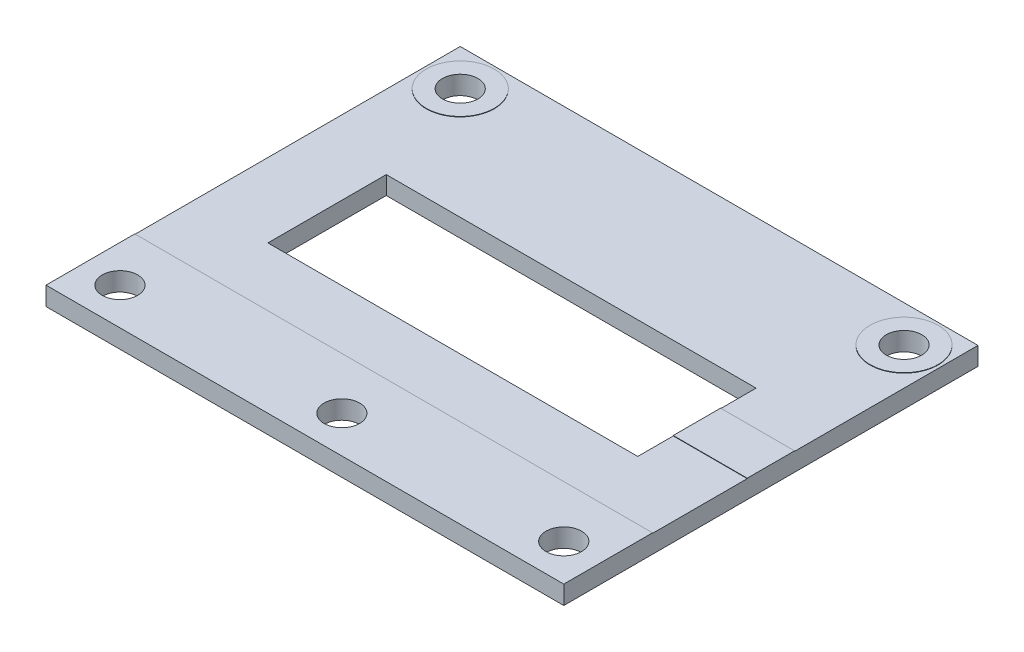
ISO-10303-21;
HEADER;
FILE_DESCRIPTION(('STEP AP214'),'2;1');
FILE_NAME('part.step','',(''),(''),'','','');
FILE_SCHEMA(('AUTOMOTIVE_DESIGN { 1 0 10303 214 1 1 1 1 }'));
ENDSEC;
DATA;
#1=APPLICATION_CONTEXT('core data for automotive mechanical design processes');
#2=APPLICATION_PROTOCOL_DEFINITION('international standard','automotive_design',2000,#1);
#3=PRODUCT_CONTEXT('',#1,'mechanical');
#4=PRODUCT('Part','Part','',(#3));
#5=PRODUCT_RELATED_PRODUCT_CATEGORY('part','',(#4));
#6=PRODUCT_DEFINITION_FORMATION('','',#4);
#7=PRODUCT_DEFINITION_CONTEXT('part definition',#1,'design');
#8=PRODUCT_DEFINITION('design','',#6,#7);
#9=PRODUCT_DEFINITION_SHAPE('','',#8);
#10=(LENGTH_UNIT() NAMED_UNIT(*) SI_UNIT(.MILLI.,.METRE.));
#11=(NAMED_UNIT(*) PLANE_ANGLE_UNIT() SI_UNIT($,.RADIAN.));
#12=(NAMED_UNIT(*) SI_UNIT($,.STERADIAN.) SOLID_ANGLE_UNIT());
#13=UNCERTAINTY_MEASURE_WITH_UNIT(LENGTH_MEASURE(1.E-05),#10,'distance_accuracy_value','');
#14=(GEOMETRIC_REPRESENTATION_CONTEXT(3) GLOBAL_UNCERTAINTY_ASSIGNED_CONTEXT((#13)) GLOBAL_UNIT_ASSIGNED_CONTEXT((#10,
#11,#12)) REPRESENTATION_CONTEXT('',''));
#15=CARTESIAN_POINT('',(0.,0.,0.));
#16=DIRECTION('',(0.,0.,1.));
#17=DIRECTION('',(1.,0.,0.));
#18=AXIS2_PLACEMENT_3D('',#15,#16,#17);
#19=CARTESIAN_POINT('',(0.,1.524,0.));
#20=DIRECTION('',(0.,-1.,0.));
#21=DIRECTION('',(0.,0.,-1.));
#22=AXIS2_PLACEMENT_3D('',#19,#20,#21);
#23=PLANE('',#22);
#24=CARTESIAN_POINT('',(-19.05,1.524,-14.605));
#25=DIRECTION('',(0.,-1.,0.));
#26=DIRECTION('',(0.,0.,-1.));
#27=AXIS2_PLACEMENT_3D('',#24,#25,#26);
#28=CIRCLE('',#27,2.921);
#29=CARTESIAN_POINT('',(-19.05,1.524,-17.526));
#30=VERTEX_POINT('',#29);
#31=EDGE_CURVE('E47',#30,#30,#28,.F.);
#32=ORIENTED_EDGE('',*,*,#31,.F.);
#33=EDGE_LOOP('',(#32));
#34=FACE_BOUND('',#33,.T.);
#35=CARTESIAN_POINT('',(19.05,1.524,-14.605));
#36=DIRECTION('',(0.,-1.,0.));
#37=DIRECTION('',(0.,0.,-1.));
#38=AXIS2_PLACEMENT_3D('',#35,#36,#37);
#39=CIRCLE('',#38,2.921);
#40=CARTESIAN_POINT('',(19.05,1.524,-17.526));
#41=VERTEX_POINT('',#40);
#42=EDGE_CURVE('E11',#41,#41,#39,.F.);
#43=ORIENTED_EDGE('',*,*,#42,.F.);
#44=EDGE_LOOP('',(#43));
#45=FACE_BOUND('',#44,.T.);
#46=DIRECTION('',(-1.,0.,0.));
#47=VECTOR('',#46,1.);
#48=CARTESIAN_POINT('',(15.875,1.524,-2.032));
#49=LINE('',#48,#47);
#50=CARTESIAN_POINT('',(22.225,1.524,-2.032));
#51=VERTEX_POINT('',#50);
#52=CARTESIAN_POINT('',(15.875,1.524,-2.032));
#53=VERTEX_POINT('',#52);
#54=EDGE_CURVE('E298',#51,#53,#49,.T.);
#55=ORIENTED_EDGE('',*,*,#54,.F.);
#56=DIRECTION('',(0.,0.,-1.));
#57=VECTOR('',#56,1.);
#58=CARTESIAN_POINT('',(22.225,1.524,17.78));
#59=LINE('',#58,#57);
#60=CARTESIAN_POINT('',(22.225,1.524,-17.78));
#61=VERTEX_POINT('',#60);
#62=EDGE_CURVE('E165',#51,#61,#59,.T.);
#63=ORIENTED_EDGE('',*,*,#62,.T.);
#64=DIRECTION('',(-1.,0.,0.));
#65=VECTOR('',#64,1.);
#66=CARTESIAN_POINT('',(-22.225,1.524,-17.78));
#67=LINE('',#66,#65);
#68=CARTESIAN_POINT('',(-22.225,1.524,-17.78));
#69=VERTEX_POINT('',#68);
#70=EDGE_CURVE('E277',#61,#69,#67,.T.);
#71=ORIENTED_EDGE('',*,*,#70,.T.);
#72=DIRECTION('',(0.,0.,1.));
#73=VECTOR('',#72,1.);
#74=CARTESIAN_POINT('',(-22.225,1.524,17.78));
#75=LINE('',#74,#73);
#76=CARTESIAN_POINT('',(-22.225,1.524,10.16));
#77=VERTEX_POINT('',#76);
#78=EDGE_CURVE('E279',#69,#77,#75,.T.);
#79=ORIENTED_EDGE('',*,*,#78,.T.);
#80=DIRECTION('',(-1.,0.,0.));
#81=VECTOR('',#80,1.);
#82=CARTESIAN_POINT('',(-22.225,1.524,10.16));
#83=LINE('',#82,#81);
#84=CARTESIAN_POINT('',(22.225,1.524,10.16));
#85=VERTEX_POINT('',#84);
#86=EDGE_CURVE('E255',#85,#77,#83,.T.);
#87=ORIENTED_EDGE('',*,*,#86,.F.);
#88=CARTESIAN_POINT('',(22.225,1.524,2.032));
#89=VERTEX_POINT('',#88);
#90=EDGE_CURVE('E274',#85,#89,#59,.T.);
#91=ORIENTED_EDGE('',*,*,#90,.T.);
#92=DIRECTION('',(1.,0.,0.));
#93=VECTOR('',#92,1.);
#94=CARTESIAN_POINT('',(15.875,1.524,2.032));
#95=LINE('',#94,#93);
#96=CARTESIAN_POINT('',(15.875,1.524,2.032));
#97=VERTEX_POINT('',#96);
#98=EDGE_CURVE('E161',#97,#89,#95,.T.);
#99=ORIENTED_EDGE('',*,*,#98,.F.);
#100=DIRECTION('',(0.,0.,-1.));
#101=VECTOR('',#100,1.);
#102=CARTESIAN_POINT('',(15.875,1.524,5.08));
#103=LINE('',#102,#101);
#104=CARTESIAN_POINT('',(15.875,1.524,5.08));
#105=VERTEX_POINT('',#104);
#106=EDGE_CURVE('E219',#105,#97,#103,.T.);
#107=ORIENTED_EDGE('',*,*,#106,.F.);
#108=DIRECTION('',(1.,0.,0.));
#109=VECTOR('',#108,1.);
#110=CARTESIAN_POINT('',(-15.875,1.524,5.08));
#111=LINE('',#110,#109);
#112=CARTESIAN_POINT('',(-15.875,1.524,5.08));
#113=VERTEX_POINT('',#112);
#114=EDGE_CURVE('E209',#113,#105,#111,.T.);
#115=ORIENTED_EDGE('',*,*,#114,.F.);
#116=DIRECTION('',(0.,0.,1.));
#117=VECTOR('',#116,1.);
#118=CARTESIAN_POINT('',(-15.875,1.524,5.08));
#119=LINE('',#118,#117);
#120=CARTESIAN_POINT('',(-15.875,1.524,-5.08));
#121=VERTEX_POINT('',#120);
#122=EDGE_CURVE('E225',#121,#113,#119,.T.);
#123=ORIENTED_EDGE('',*,*,#122,.F.);
#124=DIRECTION('',(-1.,0.,0.));
#125=VECTOR('',#124,1.);
#126=CARTESIAN_POINT('',(-15.875,1.524,-5.08));
#127=LINE('',#126,#125);
#128=CARTESIAN_POINT('',(15.875,1.524,-5.08));
#129=VERTEX_POINT('',#128);
#130=EDGE_CURVE('E222',#129,#121,#127,.T.);
#131=ORIENTED_EDGE('',*,*,#130,.F.);
#132=EDGE_CURVE('E62',#53,#129,#103,.T.);
#133=ORIENTED_EDGE('',*,*,#132,.F.);
#134=EDGE_LOOP('',(#55,#63,#71,#79,#87,#91,#99,#107,#115,#123,#131,#133));
#135=FACE_BOUND('',#134,.T.);
#136=ADVANCED_FACE('F39',(#34,#45,#135),#23,.F.);
#137=CARTESIAN_POINT('',(22.225,1.524,17.78));
#138=DIRECTION('',(-1.,0.,0.));
#139=DIRECTION('',(0.,0.,1.));
#140=AXIS2_PLACEMENT_3D('',#137,#138,#139);
#141=PLANE('',#140);
#142=DIRECTION('',(0.,-1.,0.));
#143=VECTOR('',#142,1.);
#144=CARTESIAN_POINT('',(22.225,1.524,17.78));
#145=LINE('',#144,#143);
#146=CARTESIAN_POINT('',(22.225,1.55956,17.78));
#147=VERTEX_POINT('',#146);
#148=CARTESIAN_POINT('',(22.225,-0.03556,17.78));
#149=VERTEX_POINT('',#148);
#150=EDGE_CURVE('E281',#147,#149,#145,.T.);
#151=ORIENTED_EDGE('',*,*,#150,.T.);
#152=DIRECTION('',(0.,0.,1.));
#153=VECTOR('',#152,1.);
#154=CARTESIAN_POINT('',(22.225,-0.03556,-17.78));
#155=LINE('',#154,#153);
#156=CARTESIAN_POINT('',(22.225,-0.03556,-17.78));
#157=VERTEX_POINT('',#156);
#158=EDGE_CURVE('E232',#157,#149,#155,.T.);
#159=ORIENTED_EDGE('',*,*,#158,.F.);
#160=DIRECTION('',(0.,-1.,0.));
#161=VECTOR('',#160,1.);
#162=CARTESIAN_POINT('',(22.225,1.524,-17.78));
#163=LINE('',#162,#161);
#164=EDGE_CURVE('E287',#61,#157,#163,.T.);
#165=ORIENTED_EDGE('',*,*,#164,.F.);
#166=ORIENTED_EDGE('',*,*,#62,.F.);
#167=DIRECTION('',(0.,-1.,0.));
#168=VECTOR('',#167,1.);
#169=CARTESIAN_POINT('',(22.225,1.55956,-2.032));
#170=LINE('',#169,#168);
#171=CARTESIAN_POINT('',(22.225,1.55956,-2.032));
#172=VERTEX_POINT('',#171);
#173=EDGE_CURVE('E146',#172,#51,#170,.T.);
#174=ORIENTED_EDGE('',*,*,#173,.F.);
#175=DIRECTION('',(0.,0.,-1.));
#176=VECTOR('',#175,1.);
#177=CARTESIAN_POINT('',(22.225,1.55956,2.032));
#178=LINE('',#177,#176);
#179=CARTESIAN_POINT('',(22.225,1.55956,2.032));
#180=VERTEX_POINT('',#179);
#181=EDGE_CURVE('E151',#180,#172,#178,.T.);
#182=ORIENTED_EDGE('',*,*,#181,.F.);
#183=DIRECTION('',(0.,-1.,0.));
#184=VECTOR('',#183,1.);
#185=CARTESIAN_POINT('',(22.225,1.55956,2.032));
#186=LINE('',#185,#184);
#187=EDGE_CURVE('E308',#180,#89,#186,.T.);
#188=ORIENTED_EDGE('',*,*,#187,.T.);
#189=ORIENTED_EDGE('',*,*,#90,.F.);
#190=DIRECTION('',(0.,-1.,0.));
#191=VECTOR('',#190,1.);
#192=CARTESIAN_POINT('',(22.225,1.55956,10.16));
#193=LINE('',#192,#191);
#194=CARTESIAN_POINT('',(22.225,1.55956,10.16));
#195=VERTEX_POINT('',#194);
#196=EDGE_CURVE('E271',#195,#85,#193,.T.);
#197=ORIENTED_EDGE('',*,*,#196,.F.);
#198=DIRECTION('',(0.,0.,-1.));
#199=VECTOR('',#198,1.);
#200=CARTESIAN_POINT('',(22.225,1.55956,10.16));
#201=LINE('',#200,#199);
#202=EDGE_CURVE('E262',#147,#195,#201,.T.);
#203=ORIENTED_EDGE('',*,*,#202,.F.);
#204=EDGE_LOOP('',(#151,#159,#165,#166,#174,#182,#188,#189,#197,#203));
#205=FACE_BOUND('',#204,.T.);
#206=ADVANCED_FACE('F41',(#205),#141,.F.);
#207=CARTESIAN_POINT('',(-22.225,1.524,-17.78));
#208=DIRECTION('',(0.,0.,1.));
#209=DIRECTION('',(1.,0.,0.));
#210=AXIS2_PLACEMENT_3D('',#207,#208,#209);
#211=PLANE('',#210);
#212=ORIENTED_EDGE('',*,*,#164,.T.);
#213=DIRECTION('',(1.,0.,0.));
#214=VECTOR('',#213,1.);
#215=CARTESIAN_POINT('',(-22.225,-0.03556,-17.78));
#216=LINE('',#215,#214);
#217=CARTESIAN_POINT('',(-22.225,-0.03556,-17.78));
#218=VERTEX_POINT('',#217);
#219=EDGE_CURVE('E246',#218,#157,#216,.T.);
#220=ORIENTED_EDGE('',*,*,#219,.F.);
#221=DIRECTION('',(0.,-1.,0.));
#222=VECTOR('',#221,1.);
#223=CARTESIAN_POINT('',(-22.225,1.524,-17.78));
#224=LINE('',#223,#222);
#225=EDGE_CURVE('E285',#69,#218,#224,.T.);
#226=ORIENTED_EDGE('',*,*,#225,.F.);
#227=ORIENTED_EDGE('',*,*,#70,.F.);
#228=EDGE_LOOP('',(#212,#220,#226,#227));
#229=FACE_BOUND('',#228,.T.);
#230=ADVANCED_FACE('F350',(#229),#211,.F.);
#231=CARTESIAN_POINT('',(-22.225,1.524,17.78));
#232=DIRECTION('',(1.,0.,0.));
#233=DIRECTION('',(0.,0.,-1.));
#234=AXIS2_PLACEMENT_3D('',#231,#232,#233);
#235=PLANE('',#234);
#236=ORIENTED_EDGE('',*,*,#225,.T.);
#237=DIRECTION('',(0.,0.,-1.));
#238=VECTOR('',#237,1.);
#239=CARTESIAN_POINT('',(-22.225,-0.03556,-17.78));
#240=LINE('',#239,#238);
#241=CARTESIAN_POINT('',(-22.225,-0.03556,17.78));
#242=VERTEX_POINT('',#241);
#243=EDGE_CURVE('E243',#242,#218,#240,.T.);
#244=ORIENTED_EDGE('',*,*,#243,.F.);
#245=DIRECTION('',(0.,-1.,0.));
#246=VECTOR('',#245,1.);
#247=CARTESIAN_POINT('',(-22.225,1.524,17.78));
#248=LINE('',#247,#246);
#249=CARTESIAN_POINT('',(-22.225,1.55956,17.78));
#250=VERTEX_POINT('',#249);
#251=EDGE_CURVE('E283',#250,#242,#248,.T.);
#252=ORIENTED_EDGE('',*,*,#251,.F.);
#253=DIRECTION('',(0.,0.,1.));
#254=VECTOR('',#253,1.);
#255=CARTESIAN_POINT('',(-22.225,1.55956,17.78));
#256=LINE('',#255,#254);
#257=CARTESIAN_POINT('',(-22.225,1.55956,10.16));
#258=VERTEX_POINT('',#257);
#259=EDGE_CURVE('E256',#258,#250,#256,.T.);
#260=ORIENTED_EDGE('',*,*,#259,.F.);
#261=DIRECTION('',(0.,-1.,0.));
#262=VECTOR('',#261,1.);
#263=CARTESIAN_POINT('',(-22.225,1.55956,10.16));
#264=LINE('',#263,#262);
#265=EDGE_CURVE('E266',#258,#77,#264,.T.);
#266=ORIENTED_EDGE('',*,*,#265,.T.);
#267=ORIENTED_EDGE('',*,*,#78,.F.);
#268=EDGE_LOOP('',(#236,#244,#252,#260,#266,#267));
#269=FACE_BOUND('',#268,.T.);
#270=ADVANCED_FACE('F346',(#269),#235,.F.);
#271=CARTESIAN_POINT('',(-22.225,1.524,17.78));
#272=DIRECTION('',(0.,0.,-1.));
#273=DIRECTION('',(-1.,0.,0.));
#274=AXIS2_PLACEMENT_3D('',#271,#272,#273);
#275=PLANE('',#274);
#276=ORIENTED_EDGE('',*,*,#251,.T.);
#277=DIRECTION('',(-1.,0.,0.));
#278=VECTOR('',#277,1.);
#279=CARTESIAN_POINT('',(-22.225,-0.03556,17.78));
#280=LINE('',#279,#278);
#281=EDGE_CURVE('E240',#149,#242,#280,.T.);
#282=ORIENTED_EDGE('',*,*,#281,.F.);
#283=ORIENTED_EDGE('',*,*,#150,.F.);
#284=DIRECTION('',(1.,0.,0.));
#285=VECTOR('',#284,1.);
#286=CARTESIAN_POINT('',(22.225,1.55956,17.78));
#287=LINE('',#286,#285);
#288=EDGE_CURVE('E259',#250,#147,#287,.T.);
#289=ORIENTED_EDGE('',*,*,#288,.F.);
#290=EDGE_LOOP('',(#276,#282,#283,#289));
#291=FACE_BOUND('',#290,.T.);
#292=ADVANCED_FACE('F343',(#291),#275,.F.);
#293=CARTESIAN_POINT('',(-22.225,1.55956,10.16));
#294=DIRECTION('',(0.,0.,1.));
#295=DIRECTION('',(1.,0.,0.));
#296=AXIS2_PLACEMENT_3D('',#293,#294,#295);
#297=PLANE('',#296);
#298=ORIENTED_EDGE('',*,*,#86,.T.);
#299=ORIENTED_EDGE('',*,*,#265,.F.);
#300=DIRECTION('',(-1.,0.,0.));
#301=VECTOR('',#300,1.);
#302=CARTESIAN_POINT('',(-22.225,1.55956,10.16));
#303=LINE('',#302,#301);
#304=EDGE_CURVE('E264',#195,#258,#303,.T.);
#305=ORIENTED_EDGE('',*,*,#304,.F.);
#306=ORIENTED_EDGE('',*,*,#196,.T.);
#307=EDGE_LOOP('',(#298,#299,#305,#306));
#308=FACE_BOUND('',#307,.T.);
#309=ADVANCED_FACE('F353',(#308),#297,.F.);
#310=CARTESIAN_POINT('',(0.,1.55956,0.));
#311=DIRECTION('',(0.,-1.,0.));
#312=DIRECTION('',(0.,0.,-1.));
#313=AXIS2_PLACEMENT_3D('',#310,#311,#312);
#314=PLANE('',#313);
#315=CARTESIAN_POINT('',(0.,1.55956,14.605));
#316=DIRECTION('',(0.,1.,0.));
#317=DIRECTION('',(0.,0.,1.));
#318=AXIS2_PLACEMENT_3D('',#315,#316,#317);
#319=CIRCLE('',#318,1.524);
#320=CARTESIAN_POINT('',(0.,1.55956,16.129));
#321=VERTEX_POINT('',#320);
#322=EDGE_CURVE('E181',#321,#321,#319,.T.);
#323=ORIENTED_EDGE('',*,*,#322,.F.);
#324=EDGE_LOOP('',(#323));
#325=FACE_BOUND('',#324,.T.);
#326=CARTESIAN_POINT('',(-19.05,1.55956,14.605));
#327=DIRECTION('',(0.,1.,0.));
#328=DIRECTION('',(0.,0.,1.));
#329=AXIS2_PLACEMENT_3D('',#326,#327,#328);
#330=CIRCLE('',#329,1.524);
#331=CARTESIAN_POINT('',(-19.05,1.55956,16.129));
#332=VERTEX_POINT('',#331);
#333=EDGE_CURVE('E182',#332,#332,#330,.T.);
#334=ORIENTED_EDGE('',*,*,#333,.F.);
#335=EDGE_LOOP('',(#334));
#336=FACE_BOUND('',#335,.T.);
#337=CARTESIAN_POINT('',(19.05,1.55956,14.605));
#338=DIRECTION('',(0.,1.,0.));
#339=DIRECTION('',(0.,0.,1.));
#340=AXIS2_PLACEMENT_3D('',#337,#338,#339);
#341=CIRCLE('',#340,1.524);
#342=CARTESIAN_POINT('',(19.05,1.55956,16.129));
#343=VERTEX_POINT('',#342);
#344=EDGE_CURVE('E167',#343,#343,#341,.T.);
#345=ORIENTED_EDGE('',*,*,#344,.F.);
#346=EDGE_LOOP('',(#345));
#347=FACE_BOUND('',#346,.T.);
#348=ORIENTED_EDGE('',*,*,#259,.T.);
#349=ORIENTED_EDGE('',*,*,#288,.T.);
#350=ORIENTED_EDGE('',*,*,#202,.T.);
#351=ORIENTED_EDGE('',*,*,#304,.T.);
#352=EDGE_LOOP('',(#348,#349,#350,#351));
#353=FACE_BOUND('',#352,.T.);
#354=ADVANCED_FACE('F356',(#325,#336,#347,#353),#314,.F.);
#355=CARTESIAN_POINT('',(-19.05,1.55956,-14.605));
#356=DIRECTION('',(0.,-1.,0.));
#357=DIRECTION('',(0.,0.,-1.));
#358=AXIS2_PLACEMENT_3D('',#355,#356,#357);
#359=CYLINDRICAL_SURFACE('',#358,2.921);
#360=CARTESIAN_POINT('',(-19.05,1.55956,-14.605));
#361=DIRECTION('',(0.,1.,0.));
#362=DIRECTION('',(0.,0.,1.));
#363=AXIS2_PLACEMENT_3D('',#360,#361,#362);
#364=CIRCLE('',#363,2.921);
#365=CARTESIAN_POINT('',(-19.05,1.55956,-11.684));
#366=VERTEX_POINT('',#365);
#367=EDGE_CURVE('E252',#366,#366,#364,.T.);
#368=ORIENTED_EDGE('',*,*,#367,.F.);
#369=EDGE_LOOP('',(#368));
#370=FACE_BOUND('',#369,.T.);
#371=ORIENTED_EDGE('',*,*,#31,.T.);
#372=EDGE_LOOP('',(#371));
#373=FACE_BOUND('',#372,.T.);
#374=ADVANCED_FACE('F291',(#370,#373),#359,.T.);
#375=CARTESIAN_POINT('',(-19.05,1.55956,-14.605));
#376=DIRECTION('',(0.,1.,0.));
#377=DIRECTION('',(0.,0.,1.));
#378=AXIS2_PLACEMENT_3D('',#375,#376,#377);
#379=PLANE('',#378);
#380=CARTESIAN_POINT('',(-19.05,1.55956,-14.605));
#381=DIRECTION('',(0.,1.,0.));
#382=DIRECTION('',(0.,0.,1.));
#383=AXIS2_PLACEMENT_3D('',#380,#381,#382);
#384=CIRCLE('',#383,1.524);
#385=CARTESIAN_POINT('',(-19.05,1.55956,-13.081));
#386=VERTEX_POINT('',#385);
#387=EDGE_CURVE('E190',#386,#386,#384,.T.);
#388=ORIENTED_EDGE('',*,*,#387,.F.);
#389=EDGE_LOOP('',(#388));
#390=FACE_BOUND('',#389,.T.);
#391=ORIENTED_EDGE('',*,*,#367,.T.);
#392=EDGE_LOOP('',(#391));
#393=FACE_BOUND('',#392,.T.);
#394=ADVANCED_FACE('F364',(#390,#393),#379,.T.);
#395=CARTESIAN_POINT('',(19.05,1.55956,-14.605));
#396=DIRECTION('',(0.,-1.,0.));
#397=DIRECTION('',(0.,0.,-1.));
#398=AXIS2_PLACEMENT_3D('',#395,#396,#397);
#399=CYLINDRICAL_SURFACE('',#398,2.921);
#400=CARTESIAN_POINT('',(19.05,1.55956,-14.605));
#401=DIRECTION('',(0.,1.,0.));
#402=DIRECTION('',(0.,0.,1.));
#403=AXIS2_PLACEMENT_3D('',#400,#401,#402);
#404=CIRCLE('',#403,2.921);
#405=CARTESIAN_POINT('',(19.05,1.55956,-11.684));
#406=VERTEX_POINT('',#405);
#407=EDGE_CURVE('E249',#406,#406,#404,.T.);
#408=ORIENTED_EDGE('',*,*,#407,.F.);
#409=EDGE_LOOP('',(#408));
#410=FACE_BOUND('',#409,.T.);
#411=ORIENTED_EDGE('',*,*,#42,.T.);
#412=EDGE_LOOP('',(#411));
#413=FACE_BOUND('',#412,.T.);
#414=ADVANCED_FACE('F529',(#410,#413),#399,.T.);
#415=CARTESIAN_POINT('',(19.05,1.55956,-14.605));
#416=DIRECTION('',(0.,1.,0.));
#417=DIRECTION('',(0.,0.,1.));
#418=AXIS2_PLACEMENT_3D('',#415,#416,#417);
#419=PLANE('',#418);
#420=CARTESIAN_POINT('',(19.05,1.55956,-14.605));
#421=DIRECTION('',(0.,1.,0.));
#422=DIRECTION('',(0.,0.,1.));
#423=AXIS2_PLACEMENT_3D('',#420,#421,#422);
#424=CIRCLE('',#423,1.524);
#425=CARTESIAN_POINT('',(19.05,1.55956,-13.081));
#426=VERTEX_POINT('',#425);
#427=EDGE_CURVE('E191',#426,#426,#424,.T.);
#428=ORIENTED_EDGE('',*,*,#427,.F.);
#429=EDGE_LOOP('',(#428));
#430=FACE_BOUND('',#429,.T.);
#431=ORIENTED_EDGE('',*,*,#407,.T.);
#432=EDGE_LOOP('',(#431));
#433=FACE_BOUND('',#432,.T.);
#434=ADVANCED_FACE('F332',(#430,#433),#419,.T.);
#435=CARTESIAN_POINT('',(0.,-0.03556,0.));
#436=DIRECTION('',(0.,1.,0.));
#437=DIRECTION('',(0.,0.,1.));
#438=AXIS2_PLACEMENT_3D('',#435,#436,#437);
#439=PLANE('',#438);
#440=CARTESIAN_POINT('',(19.05,-0.03556,-14.605));
#441=DIRECTION('',(0.,1.,0.));
#442=DIRECTION('',(0.,0.,1.));
#443=AXIS2_PLACEMENT_3D('',#440,#441,#442);
#444=CIRCLE('',#443,1.524);
#445=CARTESIAN_POINT('',(19.05,-0.03556,-13.081));
#446=VERTEX_POINT('',#445);
#447=EDGE_CURVE('E187',#446,#446,#444,.T.);
#448=ORIENTED_EDGE('',*,*,#447,.T.);
#449=EDGE_LOOP('',(#448));
#450=FACE_BOUND('',#449,.T.);
#451=CARTESIAN_POINT('',(0.,-0.03556,14.605));
#452=DIRECTION('',(0.,1.,0.));
#453=DIRECTION('',(0.,0.,1.));
#454=AXIS2_PLACEMENT_3D('',#451,#452,#453);
#455=CIRCLE('',#454,1.524);
#456=CARTESIAN_POINT('',(0.,-0.03556,16.129));
#457=VERTEX_POINT('',#456);
#458=EDGE_CURVE('E194',#457,#457,#455,.T.);
#459=ORIENTED_EDGE('',*,*,#458,.T.);
#460=EDGE_LOOP('',(#459));
#461=FACE_BOUND('',#460,.T.);
#462=CARTESIAN_POINT('',(-19.05,-0.03556,14.605));
#463=DIRECTION('',(0.,1.,0.));
#464=DIRECTION('',(0.,0.,1.));
#465=AXIS2_PLACEMENT_3D('',#462,#463,#464);
#466=CIRCLE('',#465,1.524);
#467=CARTESIAN_POINT('',(-19.05,-0.03556,16.129));
#468=VERTEX_POINT('',#467);
#469=EDGE_CURVE('E178',#468,#468,#466,.T.);
#470=ORIENTED_EDGE('',*,*,#469,.T.);
#471=EDGE_LOOP('',(#470));
#472=FACE_BOUND('',#471,.T.);
#473=CARTESIAN_POINT('',(19.05,-0.03556,14.605));
#474=DIRECTION('',(0.,1.,0.));
#475=DIRECTION('',(0.,0.,1.));
#476=AXIS2_PLACEMENT_3D('',#473,#474,#475);
#477=CIRCLE('',#476,1.524);
#478=CARTESIAN_POINT('',(19.05,-0.03556,16.129));
#479=VERTEX_POINT('',#478);
#480=EDGE_CURVE('E171',#479,#479,#477,.T.);
#481=ORIENTED_EDGE('',*,*,#480,.T.);
#482=EDGE_LOOP('',(#481));
#483=FACE_BOUND('',#482,.T.);
#484=CARTESIAN_POINT('',(-19.05,-0.03556,-14.605));
#485=DIRECTION('',(0.,1.,0.));
#486=DIRECTION('',(0.,0.,1.));
#487=AXIS2_PLACEMENT_3D('',#484,#485,#486);
#488=CIRCLE('',#487,1.524);
#489=CARTESIAN_POINT('',(-19.05,-0.03556,-13.081));
#490=VERTEX_POINT('',#489);
#491=EDGE_CURVE('E199',#490,#490,#488,.T.);
#492=ORIENTED_EDGE('',*,*,#491,.T.);
#493=EDGE_LOOP('',(#492));
#494=FACE_BOUND('',#493,.T.);
#495=DIRECTION('',(1.,0.,0.));
#496=VECTOR('',#495,1.);
#497=CARTESIAN_POINT('',(-15.875,-0.03556,5.08));
#498=LINE('',#497,#496);
#499=CARTESIAN_POINT('',(-15.875,-0.03556,5.08));
#500=VERTEX_POINT('',#499);
#501=CARTESIAN_POINT('',(15.875,-0.03556,5.08));
#502=VERTEX_POINT('',#501);
#503=EDGE_CURVE('E215',#500,#502,#498,.T.);
#504=ORIENTED_EDGE('',*,*,#503,.T.);
#505=DIRECTION('',(0.,0.,-1.));
#506=VECTOR('',#505,1.);
#507=CARTESIAN_POINT('',(15.875,-0.03556,5.08));
#508=LINE('',#507,#506);
#509=CARTESIAN_POINT('',(15.875,-0.03556,-5.08));
#510=VERTEX_POINT('',#509);
#511=EDGE_CURVE('E204',#502,#510,#508,.T.);
#512=ORIENTED_EDGE('',*,*,#511,.T.);
#513=DIRECTION('',(-1.,0.,0.));
#514=VECTOR('',#513,1.);
#515=CARTESIAN_POINT('',(-15.875,-0.03556,-5.08));
#516=LINE('',#515,#514);
#517=CARTESIAN_POINT('',(-15.875,-0.03556,-5.08));
#518=VERTEX_POINT('',#517);
#519=EDGE_CURVE('E208',#510,#518,#516,.T.);
#520=ORIENTED_EDGE('',*,*,#519,.T.);
#521=DIRECTION('',(0.,0.,1.));
#522=VECTOR('',#521,1.);
#523=CARTESIAN_POINT('',(-15.875,-0.03556,5.08));
#524=LINE('',#523,#522);
#525=EDGE_CURVE('E212',#518,#500,#524,.T.);
#526=ORIENTED_EDGE('',*,*,#525,.T.);
#527=EDGE_LOOP('',(#504,#512,#520,#526));
#528=FACE_BOUND('',#527,.T.);
#529=ORIENTED_EDGE('',*,*,#158,.T.);
#530=ORIENTED_EDGE('',*,*,#281,.T.);
#531=ORIENTED_EDGE('',*,*,#243,.T.);
#532=ORIENTED_EDGE('',*,*,#219,.T.);
#533=EDGE_LOOP('',(#529,#530,#531,#532));
#534=FACE_BOUND('',#533,.T.);
#535=ADVANCED_FACE('F329',(#450,#461,#472,#483,#494,#528,#534),#439,.F.);
#536=CARTESIAN_POINT('',(15.875,-0.03556,5.08));
#537=DIRECTION('',(1.,0.,0.));
#538=DIRECTION('',(0.,0.,-1.));
#539=AXIS2_PLACEMENT_3D('',#536,#537,#538);
#540=PLANE('',#539);
#541=ORIENTED_EDGE('',*,*,#106,.T.);
#542=DIRECTION('',(0.,-1.,0.));
#543=VECTOR('',#542,1.);
#544=CARTESIAN_POINT('',(15.875,1.55956,2.032));
#545=LINE('',#544,#543);
#546=CARTESIAN_POINT('',(15.875,1.55956,2.032));
#547=VERTEX_POINT('',#546);
#548=EDGE_CURVE('E174',#547,#97,#545,.T.);
#549=ORIENTED_EDGE('',*,*,#548,.F.);
#550=DIRECTION('',(0.,0.,1.));
#551=VECTOR('',#550,1.);
#552=CARTESIAN_POINT('',(15.875,1.55956,2.032));
#553=LINE('',#552,#551);
#554=CARTESIAN_POINT('',(15.875,1.55956,-2.032));
#555=VERTEX_POINT('',#554);
#556=EDGE_CURVE('E150',#555,#547,#553,.T.);
#557=ORIENTED_EDGE('',*,*,#556,.F.);
#558=DIRECTION('',(0.,-1.,0.));
#559=VECTOR('',#558,1.);
#560=CARTESIAN_POINT('',(15.875,1.55956,-2.032));
#561=LINE('',#560,#559);
#562=EDGE_CURVE('E57',#555,#53,#561,.T.);
#563=ORIENTED_EDGE('',*,*,#562,.T.);
#564=ORIENTED_EDGE('',*,*,#132,.T.);
#565=DIRECTION('',(0.,1.,0.));
#566=VECTOR('',#565,1.);
#567=CARTESIAN_POINT('',(15.875,-0.03556,-5.08));
#568=LINE('',#567,#566);
#569=EDGE_CURVE('E218',#510,#129,#568,.T.);
#570=ORIENTED_EDGE('',*,*,#569,.F.);
#571=ORIENTED_EDGE('',*,*,#511,.F.);
#572=DIRECTION('',(0.,1.,0.));
#573=VECTOR('',#572,1.);
#574=CARTESIAN_POINT('',(15.875,-0.03556,5.08));
#575=LINE('',#574,#573);
#576=EDGE_CURVE('E230',#502,#105,#575,.T.);
#577=ORIENTED_EDGE('',*,*,#576,.T.);
#578=EDGE_LOOP('',(#541,#549,#557,#563,#564,#570,#571,#577));
#579=FACE_BOUND('',#578,.T.);
#580=ADVANCED_FACE('F316',(#579),#540,.F.);
#581=CARTESIAN_POINT('',(-15.875,-0.03556,5.08));
#582=DIRECTION('',(0.,0.,1.));
#583=DIRECTION('',(1.,0.,0.));
#584=AXIS2_PLACEMENT_3D('',#581,#582,#583);
#585=PLANE('',#584);
#586=ORIENTED_EDGE('',*,*,#114,.T.);
#587=ORIENTED_EDGE('',*,*,#576,.F.);
#588=ORIENTED_EDGE('',*,*,#503,.F.);
#589=DIRECTION('',(0.,1.,0.));
#590=VECTOR('',#589,1.);
#591=CARTESIAN_POINT('',(-15.875,-0.03556,5.08));
#592=LINE('',#591,#590);
#593=EDGE_CURVE('E233',#500,#113,#592,.T.);
#594=ORIENTED_EDGE('',*,*,#593,.T.);
#595=EDGE_LOOP('',(#586,#587,#588,#594));
#596=FACE_BOUND('',#595,.T.);
#597=ADVANCED_FACE('F320',(#596),#585,.F.);
#598=CARTESIAN_POINT('',(-15.875,-0.03556,5.08));
#599=DIRECTION('',(-1.,0.,0.));
#600=DIRECTION('',(0.,0.,1.));
#601=AXIS2_PLACEMENT_3D('',#598,#599,#600);
#602=PLANE('',#601);
#603=ORIENTED_EDGE('',*,*,#122,.T.);
#604=ORIENTED_EDGE('',*,*,#593,.F.);
#605=ORIENTED_EDGE('',*,*,#525,.F.);
#606=DIRECTION('',(0.,1.,0.));
#607=VECTOR('',#606,1.);
#608=CARTESIAN_POINT('',(-15.875,-0.03556,-5.08));
#609=LINE('',#608,#607);
#610=EDGE_CURVE('E235',#518,#121,#609,.T.);
#611=ORIENTED_EDGE('',*,*,#610,.T.);
#612=EDGE_LOOP('',(#603,#604,#605,#611));
#613=FACE_BOUND('',#612,.T.);
#614=ADVANCED_FACE('F323',(#613),#602,.F.);
#615=CARTESIAN_POINT('',(-15.875,-0.03556,-5.08));
#616=DIRECTION('',(0.,0.,-1.));
#617=DIRECTION('',(-1.,0.,0.));
#618=AXIS2_PLACEMENT_3D('',#615,#616,#617);
#619=PLANE('',#618);
#620=ORIENTED_EDGE('',*,*,#130,.T.);
#621=ORIENTED_EDGE('',*,*,#610,.F.);
#622=ORIENTED_EDGE('',*,*,#519,.F.);
#623=ORIENTED_EDGE('',*,*,#569,.T.);
#624=EDGE_LOOP('',(#620,#621,#622,#623));
#625=FACE_BOUND('',#624,.T.);
#626=ADVANCED_FACE('F327',(#625),#619,.F.);
#627=CARTESIAN_POINT('',(-19.05,-0.03556,-14.605));
#628=DIRECTION('',(0.,1.,0.));
#629=DIRECTION('',(0.,0.,1.));
#630=AXIS2_PLACEMENT_3D('',#627,#628,#629);
#631=CYLINDRICAL_SURFACE('',#630,1.524);
#632=CARTESIAN_POINT('',(-19.05,-0.03556,-13.081));
#633=CARTESIAN_POINT('',(-19.05,-0.0189441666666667,-13.081));
#634=CARTESIAN_POINT('',(-19.05,-0.00232833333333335,-13.081));
#635=CARTESIAN_POINT('',(-19.05,0.0309033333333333,-13.081));
#636=CARTESIAN_POINT('',(-19.05,0.0475191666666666,-13.081));
#637=CARTESIAN_POINT('',(-19.05,0.0807508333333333,-13.081));
#638=CARTESIAN_POINT('',(-19.05,0.0973666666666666,-13.081));
#639=CARTESIAN_POINT('',(-19.05,0.130598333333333,-13.081));
#640=CARTESIAN_POINT('',(-19.05,0.147214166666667,-13.081));
#641=CARTESIAN_POINT('',(-19.05,0.180445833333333,-13.081));
#642=CARTESIAN_POINT('',(-19.05,0.197061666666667,-13.081));
#643=CARTESIAN_POINT('',(-19.05,0.230293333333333,-13.081));
#644=CARTESIAN_POINT('',(-19.05,0.246909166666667,-13.081));
#645=CARTESIAN_POINT('',(-19.05,0.280140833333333,-13.081));
#646=CARTESIAN_POINT('',(-19.05,0.296756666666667,-13.081));
#647=CARTESIAN_POINT('',(-19.05,0.329988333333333,-13.081));
#648=CARTESIAN_POINT('',(-19.05,0.346604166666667,-13.081));
#649=CARTESIAN_POINT('',(-19.05,0.379835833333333,-13.081));
#650=CARTESIAN_POINT('',(-19.05,0.396451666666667,-13.081));
#651=CARTESIAN_POINT('',(-19.05,0.429683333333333,-13.081));
#652=CARTESIAN_POINT('',(-19.05,0.446299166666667,-13.081));
#653=CARTESIAN_POINT('',(-19.05,0.479530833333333,-13.081));
#654=CARTESIAN_POINT('',(-19.05,0.496146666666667,-13.081));
#655=CARTESIAN_POINT('',(-19.05,0.529378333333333,-13.081));
#656=CARTESIAN_POINT('',(-19.05,0.545994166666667,-13.081));
#657=CARTESIAN_POINT('',(-19.05,0.579225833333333,-13.081));
#658=CARTESIAN_POINT('',(-19.05,0.595841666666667,-13.081));
#659=CARTESIAN_POINT('',(-19.05,0.629073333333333,-13.081));
#660=CARTESIAN_POINT('',(-19.05,0.645689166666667,-13.081));
#661=CARTESIAN_POINT('',(-19.05,0.678920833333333,-13.081));
#662=CARTESIAN_POINT('',(-19.05,0.695536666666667,-13.081));
#663=CARTESIAN_POINT('',(-19.05,0.728768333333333,-13.081));
#664=CARTESIAN_POINT('',(-19.05,0.745384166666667,-13.081));
#665=CARTESIAN_POINT('',(-19.05,0.778615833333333,-13.081));
#666=CARTESIAN_POINT('',(-19.05,0.795231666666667,-13.081));
#667=CARTESIAN_POINT('',(-19.05,0.828463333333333,-13.081));
#668=CARTESIAN_POINT('',(-19.05,0.845079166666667,-13.081));
#669=CARTESIAN_POINT('',(-19.05,0.878310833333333,-13.081));
#670=CARTESIAN_POINT('',(-19.05,0.894926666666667,-13.081));
#671=CARTESIAN_POINT('',(-19.05,0.928158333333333,-13.081));
#672=CARTESIAN_POINT('',(-19.05,0.944774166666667,-13.081));
#673=CARTESIAN_POINT('',(-19.05,0.978005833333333,-13.081));
#674=CARTESIAN_POINT('',(-19.05,0.994621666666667,-13.081));
#675=CARTESIAN_POINT('',(-19.05,1.02785333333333,-13.081));
#676=CARTESIAN_POINT('',(-19.05,1.04446916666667,-13.081));
#677=CARTESIAN_POINT('',(-19.05,1.07770083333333,-13.081));
#678=CARTESIAN_POINT('',(-19.05,1.09431666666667,-13.081));
#679=CARTESIAN_POINT('',(-19.05,1.12754833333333,-13.081));
#680=CARTESIAN_POINT('',(-19.05,1.14416416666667,-13.081));
#681=CARTESIAN_POINT('',(-19.05,1.17739583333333,-13.081));
#682=CARTESIAN_POINT('',(-19.05,1.19401166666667,-13.081));
#683=CARTESIAN_POINT('',(-19.05,1.22724333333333,-13.081));
#684=CARTESIAN_POINT('',(-19.05,1.24385916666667,-13.081));
#685=CARTESIAN_POINT('',(-19.05,1.27709083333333,-13.081));
#686=CARTESIAN_POINT('',(-19.05,1.29370666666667,-13.081));
#687=CARTESIAN_POINT('',(-19.05,1.32693833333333,-13.081));
#688=CARTESIAN_POINT('',(-19.05,1.34355416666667,-13.081));
#689=CARTESIAN_POINT('',(-19.05,1.37678583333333,-13.081));
#690=CARTESIAN_POINT('',(-19.05,1.39340166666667,-13.081));
#691=CARTESIAN_POINT('',(-19.05,1.42663333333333,-13.081));
#692=CARTESIAN_POINT('',(-19.05,1.44324916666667,-13.081));
#693=CARTESIAN_POINT('',(-19.05,1.47648083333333,-13.081));
#694=CARTESIAN_POINT('',(-19.05,1.49309666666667,-13.081));
#695=CARTESIAN_POINT('',(-19.05,1.52632833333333,-13.081));
#696=CARTESIAN_POINT('',(-19.05,1.54294416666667,-13.081));
#697=CARTESIAN_POINT('',(-19.05,1.55956,-13.081));
#698=B_SPLINE_CURVE_WITH_KNOTS('',3,(#632,#633,#634,#635,#636,#637,#638,#639,#640,#641,#642,
#643,#644,#645,#646,#647,#648,#649,#650,#651,#652,#653,#654,#655,#656,#657,#658,#659,#660,#661,
#662,#663,#664,#665,#666,#667,#668,#669,#670,#671,#672,#673,#674,#675,#676,#677,#678,#679,#680,
#681,#682,#683,#684,#685,#686,#687,#688,#689,#690,#691,#692,#693,#694,#695,#696,#697),
.UNSPECIFIED.,.F.,.F.,(4,2,2,2,2,2,2,2,2,2,2,2,2,2,2,2,2,2,2,2,2,2,2,2,2,2,2,2,2,2,2,2,4),(0.,
0.0498475,0.099695,0.1495425,0.19939,0.2492375,0.299085,0.3489325,0.39878,0.4486275,0.498475,
0.5483225,0.59817,0.6480175,0.697865,0.7477125,0.79756,0.8474075,0.897255,0.9471025,0.99695,
1.0467975,1.096645,1.1464925,1.19634,1.2461875,1.296035,1.3458825,1.39573,1.4455775,1.495425,
1.5452725,1.59512),.UNSPECIFIED.);
#699=EDGE_CURVE('BSEAM480',#490,#386,#698,.T.);
#700=ORIENTED_EDGE('',*,*,#491,.F.);
#701=ORIENTED_EDGE('',*,*,#387,.T.);
#702=ORIENTED_EDGE('',*,*,#699,.T.);
#703=ORIENTED_EDGE('',*,*,#699,.F.);
#704=EDGE_LOOP('',(#700,#702,#701,#703));
#705=FACE_BOUND('',#704,.T.);
#706=ADVANCED_FACE('F480',(#705),#631,.F.);
#707=CARTESIAN_POINT('',(19.05,-0.03556,14.605));
#708=DIRECTION('',(0.,1.,0.));
#709=DIRECTION('',(0.,0.,1.));
#710=AXIS2_PLACEMENT_3D('',#707,#708,#709);
#711=CYLINDRICAL_SURFACE('',#710,1.524);
#712=CARTESIAN_POINT('',(19.05,-0.03556,16.129));
#713=CARTESIAN_POINT('',(19.05,-0.0189441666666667,16.129));
#714=CARTESIAN_POINT('',(19.05,-0.00232833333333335,16.129));
#715=CARTESIAN_POINT('',(19.05,0.0309033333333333,16.129));
#716=CARTESIAN_POINT('',(19.05,0.0475191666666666,16.129));
#717=CARTESIAN_POINT('',(19.05,0.0807508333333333,16.129));
#718=CARTESIAN_POINT('',(19.05,0.0973666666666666,16.129));
#719=CARTESIAN_POINT('',(19.05,0.130598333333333,16.129));
#720=CARTESIAN_POINT('',(19.05,0.147214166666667,16.129));
#721=CARTESIAN_POINT('',(19.05,0.180445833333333,16.129));
#722=CARTESIAN_POINT('',(19.05,0.197061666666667,16.129));
#723=CARTESIAN_POINT('',(19.05,0.230293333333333,16.129));
#724=CARTESIAN_POINT('',(19.05,0.246909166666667,16.129));
#725=CARTESIAN_POINT('',(19.05,0.280140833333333,16.129));
#726=CARTESIAN_POINT('',(19.05,0.296756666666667,16.129));
#727=CARTESIAN_POINT('',(19.05,0.329988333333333,16.129));
#728=CARTESIAN_POINT('',(19.05,0.346604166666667,16.129));
#729=CARTESIAN_POINT('',(19.05,0.379835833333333,16.129));
#730=CARTESIAN_POINT('',(19.05,0.396451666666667,16.129));
#731=CARTESIAN_POINT('',(19.05,0.429683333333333,16.129));
#732=CARTESIAN_POINT('',(19.05,0.446299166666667,16.129));
#733=CARTESIAN_POINT('',(19.05,0.479530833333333,16.129));
#734=CARTESIAN_POINT('',(19.05,0.496146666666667,16.129));
#735=CARTESIAN_POINT('',(19.05,0.529378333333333,16.129));
#736=CARTESIAN_POINT('',(19.05,0.545994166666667,16.129));
#737=CARTESIAN_POINT('',(19.05,0.579225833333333,16.129));
#738=CARTESIAN_POINT('',(19.05,0.595841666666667,16.129));
#739=CARTESIAN_POINT('',(19.05,0.629073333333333,16.129));
#740=CARTESIAN_POINT('',(19.05,0.645689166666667,16.129));
#741=CARTESIAN_POINT('',(19.05,0.678920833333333,16.129));
#742=CARTESIAN_POINT('',(19.05,0.695536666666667,16.129));
#743=CARTESIAN_POINT('',(19.05,0.728768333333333,16.129));
#744=CARTESIAN_POINT('',(19.05,0.745384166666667,16.129));
#745=CARTESIAN_POINT('',(19.05,0.778615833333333,16.129));
#746=CARTESIAN_POINT('',(19.05,0.795231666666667,16.129));
#747=CARTESIAN_POINT('',(19.05,0.828463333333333,16.129));
#748=CARTESIAN_POINT('',(19.05,0.845079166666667,16.129));
#749=CARTESIAN_POINT('',(19.05,0.878310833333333,16.129));
#750=CARTESIAN_POINT('',(19.05,0.894926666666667,16.129));
#751=CARTESIAN_POINT('',(19.05,0.928158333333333,16.129));
#752=CARTESIAN_POINT('',(19.05,0.944774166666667,16.129));
#753=CARTESIAN_POINT('',(19.05,0.978005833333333,16.129));
#754=CARTESIAN_POINT('',(19.05,0.994621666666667,16.129));
#755=CARTESIAN_POINT('',(19.05,1.02785333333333,16.129));
#756=CARTESIAN_POINT('',(19.05,1.04446916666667,16.129));
#757=CARTESIAN_POINT('',(19.05,1.07770083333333,16.129));
#758=CARTESIAN_POINT('',(19.05,1.09431666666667,16.129));
#759=CARTESIAN_POINT('',(19.05,1.12754833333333,16.129));
#760=CARTESIAN_POINT('',(19.05,1.14416416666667,16.129));
#761=CARTESIAN_POINT('',(19.05,1.17739583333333,16.129));
#762=CARTESIAN_POINT('',(19.05,1.19401166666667,16.129));
#763=CARTESIAN_POINT('',(19.05,1.22724333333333,16.129));
#764=CARTESIAN_POINT('',(19.05,1.24385916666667,16.129));
#765=CARTESIAN_POINT('',(19.05,1.27709083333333,16.129));
#766=CARTESIAN_POINT('',(19.05,1.29370666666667,16.129));
#767=CARTESIAN_POINT('',(19.05,1.32693833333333,16.129));
#768=CARTESIAN_POINT('',(19.05,1.34355416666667,16.129));
#769=CARTESIAN_POINT('',(19.05,1.37678583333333,16.129));
#770=CARTESIAN_POINT('',(19.05,1.39340166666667,16.129));
#771=CARTESIAN_POINT('',(19.05,1.42663333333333,16.129));
#772=CARTESIAN_POINT('',(19.05,1.44324916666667,16.129));
#773=CARTESIAN_POINT('',(19.05,1.47648083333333,16.129));
#774=CARTESIAN_POINT('',(19.05,1.49309666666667,16.129));
#775=CARTESIAN_POINT('',(19.05,1.52632833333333,16.129));
#776=CARTESIAN_POINT('',(19.05,1.54294416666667,16.129));
#777=CARTESIAN_POINT('',(19.05,1.55956,16.129));
#778=B_SPLINE_CURVE_WITH_KNOTS('',3,(#712,#713,#714,#715,#716,#717,#718,#719,#720,#721,#722,
#723,#724,#725,#726,#727,#728,#729,#730,#731,#732,#733,#734,#735,#736,#737,#738,#739,#740,#741,
#742,#743,#744,#745,#746,#747,#748,#749,#750,#751,#752,#753,#754,#755,#756,#757,#758,#759,#760,
#761,#762,#763,#764,#765,#766,#767,#768,#769,#770,#771,#772,#773,#774,#775,#776,#777),
.UNSPECIFIED.,.F.,.F.,(4,2,2,2,2,2,2,2,2,2,2,2,2,2,2,2,2,2,2,2,2,2,2,2,2,2,2,2,2,2,2,2,4),(0.,
0.0498475,0.099695,0.1495425,0.19939,0.2492375,0.299085,0.3489325,0.39878,0.4486275,0.498475,
0.5483225,0.59817,0.6480175,0.697865,0.7477125,0.79756,0.8474075,0.897255,0.9471025,0.99695,
1.0467975,1.096645,1.1464925,1.19634,1.2461875,1.296035,1.3458825,1.39573,1.4455775,1.495425,
1.5452725,1.59512),.UNSPECIFIED.);
#779=EDGE_CURVE('BSEAM471',#479,#343,#778,.T.);
#780=ORIENTED_EDGE('',*,*,#480,.F.);
#781=ORIENTED_EDGE('',*,*,#344,.T.);
#782=ORIENTED_EDGE('',*,*,#779,.T.);
#783=ORIENTED_EDGE('',*,*,#779,.F.);
#784=EDGE_LOOP('',(#780,#782,#781,#783));
#785=FACE_BOUND('',#784,.T.);
#786=ADVANCED_FACE('F471',(#785),#711,.F.);
#787=CARTESIAN_POINT('',(-19.05,-0.03556,14.605));
#788=DIRECTION('',(0.,1.,0.));
#789=DIRECTION('',(0.,0.,1.));
#790=AXIS2_PLACEMENT_3D('',#787,#788,#789);
#791=CYLINDRICAL_SURFACE('',#790,1.524);
#792=CARTESIAN_POINT('',(-19.05,-0.03556,16.129));
#793=CARTESIAN_POINT('',(-19.05,-0.0189441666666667,16.129));
#794=CARTESIAN_POINT('',(-19.05,-0.00232833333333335,16.129));
#795=CARTESIAN_POINT('',(-19.05,0.0309033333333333,16.129));
#796=CARTESIAN_POINT('',(-19.05,0.0475191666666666,16.129));
#797=CARTESIAN_POINT('',(-19.05,0.0807508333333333,16.129));
#798=CARTESIAN_POINT('',(-19.05,0.0973666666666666,16.129));
#799=CARTESIAN_POINT('',(-19.05,0.130598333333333,16.129));
#800=CARTESIAN_POINT('',(-19.05,0.147214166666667,16.129));
#801=CARTESIAN_POINT('',(-19.05,0.180445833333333,16.129));
#802=CARTESIAN_POINT('',(-19.05,0.197061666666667,16.129));
#803=CARTESIAN_POINT('',(-19.05,0.230293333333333,16.129));
#804=CARTESIAN_POINT('',(-19.05,0.246909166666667,16.129));
#805=CARTESIAN_POINT('',(-19.05,0.280140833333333,16.129));
#806=CARTESIAN_POINT('',(-19.05,0.296756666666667,16.129));
#807=CARTESIAN_POINT('',(-19.05,0.329988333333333,16.129));
#808=CARTESIAN_POINT('',(-19.05,0.346604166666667,16.129));
#809=CARTESIAN_POINT('',(-19.05,0.379835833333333,16.129));
#810=CARTESIAN_POINT('',(-19.05,0.396451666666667,16.129));
#811=CARTESIAN_POINT('',(-19.05,0.429683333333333,16.129));
#812=CARTESIAN_POINT('',(-19.05,0.446299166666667,16.129));
#813=CARTESIAN_POINT('',(-19.05,0.479530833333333,16.129));
#814=CARTESIAN_POINT('',(-19.05,0.496146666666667,16.129));
#815=CARTESIAN_POINT('',(-19.05,0.529378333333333,16.129));
#816=CARTESIAN_POINT('',(-19.05,0.545994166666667,16.129));
#817=CARTESIAN_POINT('',(-19.05,0.579225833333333,16.129));
#818=CARTESIAN_POINT('',(-19.05,0.595841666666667,16.129));
#819=CARTESIAN_POINT('',(-19.05,0.629073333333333,16.129));
#820=CARTESIAN_POINT('',(-19.05,0.645689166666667,16.129));
#821=CARTESIAN_POINT('',(-19.05,0.678920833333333,16.129));
#822=CARTESIAN_POINT('',(-19.05,0.695536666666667,16.129));
#823=CARTESIAN_POINT('',(-19.05,0.728768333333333,16.129));
#824=CARTESIAN_POINT('',(-19.05,0.745384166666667,16.129));
#825=CARTESIAN_POINT('',(-19.05,0.778615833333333,16.129));
#826=CARTESIAN_POINT('',(-19.05,0.795231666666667,16.129));
#827=CARTESIAN_POINT('',(-19.05,0.828463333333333,16.129));
#828=CARTESIAN_POINT('',(-19.05,0.845079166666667,16.129));
#829=CARTESIAN_POINT('',(-19.05,0.878310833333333,16.129));
#830=CARTESIAN_POINT('',(-19.05,0.894926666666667,16.129));
#831=CARTESIAN_POINT('',(-19.05,0.928158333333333,16.129));
#832=CARTESIAN_POINT('',(-19.05,0.944774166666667,16.129));
#833=CARTESIAN_POINT('',(-19.05,0.978005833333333,16.129));
#834=CARTESIAN_POINT('',(-19.05,0.994621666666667,16.129));
#835=CARTESIAN_POINT('',(-19.05,1.02785333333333,16.129));
#836=CARTESIAN_POINT('',(-19.05,1.04446916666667,16.129));
#837=CARTESIAN_POINT('',(-19.05,1.07770083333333,16.129));
#838=CARTESIAN_POINT('',(-19.05,1.09431666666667,16.129));
#839=CARTESIAN_POINT('',(-19.05,1.12754833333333,16.129));
#840=CARTESIAN_POINT('',(-19.05,1.14416416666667,16.129));
#841=CARTESIAN_POINT('',(-19.05,1.17739583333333,16.129));
#842=CARTESIAN_POINT('',(-19.05,1.19401166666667,16.129));
#843=CARTESIAN_POINT('',(-19.05,1.22724333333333,16.129));
#844=CARTESIAN_POINT('',(-19.05,1.24385916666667,16.129));
#845=CARTESIAN_POINT('',(-19.05,1.27709083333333,16.129));
#846=CARTESIAN_POINT('',(-19.05,1.29370666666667,16.129));
#847=CARTESIAN_POINT('',(-19.05,1.32693833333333,16.129));
#848=CARTESIAN_POINT('',(-19.05,1.34355416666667,16.129));
#849=CARTESIAN_POINT('',(-19.05,1.37678583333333,16.129));
#850=CARTESIAN_POINT('',(-19.05,1.39340166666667,16.129));
#851=CARTESIAN_POINT('',(-19.05,1.42663333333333,16.129));
#852=CARTESIAN_POINT('',(-19.05,1.44324916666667,16.129));
#853=CARTESIAN_POINT('',(-19.05,1.47648083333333,16.129));
#854=CARTESIAN_POINT('',(-19.05,1.49309666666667,16.129));
#855=CARTESIAN_POINT('',(-19.05,1.52632833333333,16.129));
#856=CARTESIAN_POINT('',(-19.05,1.54294416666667,16.129));
#857=CARTESIAN_POINT('',(-19.05,1.55956,16.129));
#858=B_SPLINE_CURVE_WITH_KNOTS('',3,(#792,#793,#794,#795,#796,#797,#798,#799,#800,#801,#802,
#803,#804,#805,#806,#807,#808,#809,#810,#811,#812,#813,#814,#815,#816,#817,#818,#819,#820,#821,
#822,#823,#824,#825,#826,#827,#828,#829,#830,#831,#832,#833,#834,#835,#836,#837,#838,#839,#840,
#841,#842,#843,#844,#845,#846,#847,#848,#849,#850,#851,#852,#853,#854,#855,#856,#857),
.UNSPECIFIED.,.F.,.F.,(4,2,2,2,2,2,2,2,2,2,2,2,2,2,2,2,2,2,2,2,2,2,2,2,2,2,2,2,2,2,2,2,4),(0.,
0.0498475,0.099695,0.1495425,0.19939,0.2492375,0.299085,0.3489325,0.39878,0.4486275,0.498475,
0.5483225,0.59817,0.6480175,0.697865,0.7477125,0.79756,0.8474075,0.897255,0.9471025,0.99695,
1.0467975,1.096645,1.1464925,1.19634,1.2461875,1.296035,1.3458825,1.39573,1.4455775,1.495425,
1.5452725,1.59512),.UNSPECIFIED.);
#859=EDGE_CURVE('BSEAM462',#468,#332,#858,.T.);
#860=ORIENTED_EDGE('',*,*,#469,.F.);
#861=ORIENTED_EDGE('',*,*,#333,.T.);
#862=ORIENTED_EDGE('',*,*,#859,.T.);
#863=ORIENTED_EDGE('',*,*,#859,.F.);
#864=EDGE_LOOP('',(#860,#862,#861,#863));
#865=FACE_BOUND('',#864,.T.);
#866=ADVANCED_FACE('F462',(#865),#791,.F.);
#867=CARTESIAN_POINT('',(0.,-0.03556,14.605));
#868=DIRECTION('',(0.,1.,0.));
#869=DIRECTION('',(0.,0.,1.));
#870=AXIS2_PLACEMENT_3D('',#867,#868,#869);
#871=CYLINDRICAL_SURFACE('',#870,1.524);
#872=CARTESIAN_POINT('',(0.,-0.03556,16.129));
#873=CARTESIAN_POINT('',(0.,-0.0189441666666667,16.129));
#874=CARTESIAN_POINT('',(0.,-0.00232833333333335,16.129));
#875=CARTESIAN_POINT('',(0.,0.0309033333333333,16.129));
#876=CARTESIAN_POINT('',(0.,0.0475191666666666,16.129));
#877=CARTESIAN_POINT('',(0.,0.0807508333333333,16.129));
#878=CARTESIAN_POINT('',(0.,0.0973666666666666,16.129));
#879=CARTESIAN_POINT('',(0.,0.130598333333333,16.129));
#880=CARTESIAN_POINT('',(0.,0.147214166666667,16.129));
#881=CARTESIAN_POINT('',(0.,0.180445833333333,16.129));
#882=CARTESIAN_POINT('',(0.,0.197061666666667,16.129));
#883=CARTESIAN_POINT('',(0.,0.230293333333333,16.129));
#884=CARTESIAN_POINT('',(0.,0.246909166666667,16.129));
#885=CARTESIAN_POINT('',(0.,0.280140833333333,16.129));
#886=CARTESIAN_POINT('',(0.,0.296756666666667,16.129));
#887=CARTESIAN_POINT('',(0.,0.329988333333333,16.129));
#888=CARTESIAN_POINT('',(0.,0.346604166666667,16.129));
#889=CARTESIAN_POINT('',(0.,0.379835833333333,16.129));
#890=CARTESIAN_POINT('',(0.,0.396451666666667,16.129));
#891=CARTESIAN_POINT('',(0.,0.429683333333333,16.129));
#892=CARTESIAN_POINT('',(0.,0.446299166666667,16.129));
#893=CARTESIAN_POINT('',(0.,0.479530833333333,16.129));
#894=CARTESIAN_POINT('',(0.,0.496146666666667,16.129));
#895=CARTESIAN_POINT('',(0.,0.529378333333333,16.129));
#896=CARTESIAN_POINT('',(0.,0.545994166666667,16.129));
#897=CARTESIAN_POINT('',(0.,0.579225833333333,16.129));
#898=CARTESIAN_POINT('',(0.,0.595841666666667,16.129));
#899=CARTESIAN_POINT('',(0.,0.629073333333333,16.129));
#900=CARTESIAN_POINT('',(0.,0.645689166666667,16.129));
#901=CARTESIAN_POINT('',(0.,0.678920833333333,16.129));
#902=CARTESIAN_POINT('',(0.,0.695536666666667,16.129));
#903=CARTESIAN_POINT('',(0.,0.728768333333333,16.129));
#904=CARTESIAN_POINT('',(0.,0.745384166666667,16.129));
#905=CARTESIAN_POINT('',(0.,0.778615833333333,16.129));
#906=CARTESIAN_POINT('',(0.,0.795231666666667,16.129));
#907=CARTESIAN_POINT('',(0.,0.828463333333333,16.129));
#908=CARTESIAN_POINT('',(0.,0.845079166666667,16.129));
#909=CARTESIAN_POINT('',(0.,0.878310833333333,16.129));
#910=CARTESIAN_POINT('',(0.,0.894926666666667,16.129));
#911=CARTESIAN_POINT('',(0.,0.928158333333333,16.129));
#912=CARTESIAN_POINT('',(0.,0.944774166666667,16.129));
#913=CARTESIAN_POINT('',(0.,0.978005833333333,16.129));
#914=CARTESIAN_POINT('',(0.,0.994621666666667,16.129));
#915=CARTESIAN_POINT('',(0.,1.02785333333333,16.129));
#916=CARTESIAN_POINT('',(0.,1.04446916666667,16.129));
#917=CARTESIAN_POINT('',(0.,1.07770083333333,16.129));
#918=CARTESIAN_POINT('',(0.,1.09431666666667,16.129));
#919=CARTESIAN_POINT('',(0.,1.12754833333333,16.129));
#920=CARTESIAN_POINT('',(0.,1.14416416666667,16.129));
#921=CARTESIAN_POINT('',(0.,1.17739583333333,16.129));
#922=CARTESIAN_POINT('',(0.,1.19401166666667,16.129));
#923=CARTESIAN_POINT('',(0.,1.22724333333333,16.129));
#924=CARTESIAN_POINT('',(0.,1.24385916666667,16.129));
#925=CARTESIAN_POINT('',(0.,1.27709083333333,16.129));
#926=CARTESIAN_POINT('',(0.,1.29370666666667,16.129));
#927=CARTESIAN_POINT('',(0.,1.32693833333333,16.129));
#928=CARTESIAN_POINT('',(0.,1.34355416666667,16.129));
#929=CARTESIAN_POINT('',(0.,1.37678583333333,16.129));
#930=CARTESIAN_POINT('',(0.,1.39340166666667,16.129));
#931=CARTESIAN_POINT('',(0.,1.42663333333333,16.129));
#932=CARTESIAN_POINT('',(0.,1.44324916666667,16.129));
#933=CARTESIAN_POINT('',(0.,1.47648083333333,16.129));
#934=CARTESIAN_POINT('',(0.,1.49309666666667,16.129));
#935=CARTESIAN_POINT('',(0.,1.52632833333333,16.129));
#936=CARTESIAN_POINT('',(0.,1.54294416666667,16.129));
#937=CARTESIAN_POINT('',(0.,1.55956,16.129));
#938=B_SPLINE_CURVE_WITH_KNOTS('',3,(#872,#873,#874,#875,#876,#877,#878,#879,#880,#881,#882,
#883,#884,#885,#886,#887,#888,#889,#890,#891,#892,#893,#894,#895,#896,#897,#898,#899,#900,#901,
#902,#903,#904,#905,#906,#907,#908,#909,#910,#911,#912,#913,#914,#915,#916,#917,#918,#919,#920,
#921,#922,#923,#924,#925,#926,#927,#928,#929,#930,#931,#932,#933,#934,#935,#936,#937),
.UNSPECIFIED.,.F.,.F.,(4,2,2,2,2,2,2,2,2,2,2,2,2,2,2,2,2,2,2,2,2,2,2,2,2,2,2,2,2,2,2,2,4),(0.,
0.0498475,0.099695,0.1495425,0.19939,0.2492375,0.299085,0.3489325,0.39878,0.4486275,0.498475,
0.5483225,0.59817,0.6480175,0.697865,0.7477125,0.79756,0.8474075,0.897255,0.9471025,0.99695,
1.0467975,1.096645,1.1464925,1.19634,1.2461875,1.296035,1.3458825,1.39573,1.4455775,1.495425,
1.5452725,1.59512),.UNSPECIFIED.);
#939=EDGE_CURVE('BSEAM453',#457,#321,#938,.T.);
#940=ORIENTED_EDGE('',*,*,#458,.F.);
#941=ORIENTED_EDGE('',*,*,#322,.T.);
#942=ORIENTED_EDGE('',*,*,#939,.T.);
#943=ORIENTED_EDGE('',*,*,#939,.F.);
#944=EDGE_LOOP('',(#940,#942,#941,#943));
#945=FACE_BOUND('',#944,.T.);
#946=ADVANCED_FACE('F453',(#945),#871,.F.);
#947=CARTESIAN_POINT('',(19.05,-0.03556,-14.605));
#948=DIRECTION('',(0.,1.,0.));
#949=DIRECTION('',(0.,0.,1.));
#950=AXIS2_PLACEMENT_3D('',#947,#948,#949);
#951=CYLINDRICAL_SURFACE('',#950,1.524);
#952=CARTESIAN_POINT('',(19.05,-0.03556,-13.081));
#953=CARTESIAN_POINT('',(19.05,-0.0189441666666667,-13.081));
#954=CARTESIAN_POINT('',(19.05,-0.00232833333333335,-13.081));
#955=CARTESIAN_POINT('',(19.05,0.0309033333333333,-13.081));
#956=CARTESIAN_POINT('',(19.05,0.0475191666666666,-13.081));
#957=CARTESIAN_POINT('',(19.05,0.0807508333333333,-13.081));
#958=CARTESIAN_POINT('',(19.05,0.0973666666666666,-13.081));
#959=CARTESIAN_POINT('',(19.05,0.130598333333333,-13.081));
#960=CARTESIAN_POINT('',(19.05,0.147214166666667,-13.081));
#961=CARTESIAN_POINT('',(19.05,0.180445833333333,-13.081));
#962=CARTESIAN_POINT('',(19.05,0.197061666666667,-13.081));
#963=CARTESIAN_POINT('',(19.05,0.230293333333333,-13.081));
#964=CARTESIAN_POINT('',(19.05,0.246909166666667,-13.081));
#965=CARTESIAN_POINT('',(19.05,0.280140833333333,-13.081));
#966=CARTESIAN_POINT('',(19.05,0.296756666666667,-13.081));
#967=CARTESIAN_POINT('',(19.05,0.329988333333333,-13.081));
#968=CARTESIAN_POINT('',(19.05,0.346604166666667,-13.081));
#969=CARTESIAN_POINT('',(19.05,0.379835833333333,-13.081));
#970=CARTESIAN_POINT('',(19.05,0.396451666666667,-13.081));
#971=CARTESIAN_POINT('',(19.05,0.429683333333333,-13.081));
#972=CARTESIAN_POINT('',(19.05,0.446299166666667,-13.081));
#973=CARTESIAN_POINT('',(19.05,0.479530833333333,-13.081));
#974=CARTESIAN_POINT('',(19.05,0.496146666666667,-13.081));
#975=CARTESIAN_POINT('',(19.05,0.529378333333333,-13.081));
#976=CARTESIAN_POINT('',(19.05,0.545994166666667,-13.081));
#977=CARTESIAN_POINT('',(19.05,0.579225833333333,-13.081));
#978=CARTESIAN_POINT('',(19.05,0.595841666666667,-13.081));
#979=CARTESIAN_POINT('',(19.05,0.629073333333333,-13.081));
#980=CARTESIAN_POINT('',(19.05,0.645689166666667,-13.081));
#981=CARTESIAN_POINT('',(19.05,0.678920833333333,-13.081));
#982=CARTESIAN_POINT('',(19.05,0.695536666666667,-13.081));
#983=CARTESIAN_POINT('',(19.05,0.728768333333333,-13.081));
#984=CARTESIAN_POINT('',(19.05,0.745384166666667,-13.081));
#985=CARTESIAN_POINT('',(19.05,0.778615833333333,-13.081));
#986=CARTESIAN_POINT('',(19.05,0.795231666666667,-13.081));
#987=CARTESIAN_POINT('',(19.05,0.828463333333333,-13.081));
#988=CARTESIAN_POINT('',(19.05,0.845079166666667,-13.081));
#989=CARTESIAN_POINT('',(19.05,0.878310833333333,-13.081));
#990=CARTESIAN_POINT('',(19.05,0.894926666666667,-13.081));
#991=CARTESIAN_POINT('',(19.05,0.928158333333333,-13.081));
#992=CARTESIAN_POINT('',(19.05,0.944774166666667,-13.081));
#993=CARTESIAN_POINT('',(19.05,0.978005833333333,-13.081));
#994=CARTESIAN_POINT('',(19.05,0.994621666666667,-13.081));
#995=CARTESIAN_POINT('',(19.05,1.02785333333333,-13.081));
#996=CARTESIAN_POINT('',(19.05,1.04446916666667,-13.081));
#997=CARTESIAN_POINT('',(19.05,1.07770083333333,-13.081));
#998=CARTESIAN_POINT('',(19.05,1.09431666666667,-13.081));
#999=CARTESIAN_POINT('',(19.05,1.12754833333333,-13.081));
#1000=CARTESIAN_POINT('',(19.05,1.14416416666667,-13.081));
#1001=CARTESIAN_POINT('',(19.05,1.17739583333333,-13.081));
#1002=CARTESIAN_POINT('',(19.05,1.19401166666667,-13.081));
#1003=CARTESIAN_POINT('',(19.05,1.22724333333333,-13.081));
#1004=CARTESIAN_POINT('',(19.05,1.24385916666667,-13.081));
#1005=CARTESIAN_POINT('',(19.05,1.27709083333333,-13.081));
#1006=CARTESIAN_POINT('',(19.05,1.29370666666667,-13.081));
#1007=CARTESIAN_POINT('',(19.05,1.32693833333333,-13.081));
#1008=CARTESIAN_POINT('',(19.05,1.34355416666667,-13.081));
#1009=CARTESIAN_POINT('',(19.05,1.37678583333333,-13.081));
#1010=CARTESIAN_POINT('',(19.05,1.39340166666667,-13.081));
#1011=CARTESIAN_POINT('',(19.05,1.42663333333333,-13.081));
#1012=CARTESIAN_POINT('',(19.05,1.44324916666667,-13.081));
#1013=CARTESIAN_POINT('',(19.05,1.47648083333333,-13.081));
#1014=CARTESIAN_POINT('',(19.05,1.49309666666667,-13.081));
#1015=CARTESIAN_POINT('',(19.05,1.52632833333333,-13.081));
#1016=CARTESIAN_POINT('',(19.05,1.54294416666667,-13.081));
#1017=CARTESIAN_POINT('',(19.05,1.55956,-13.081));
#1018=B_SPLINE_CURVE_WITH_KNOTS('',3,(#952,#953,#954,#955,#956,#957,#958,#959,#960,#961,#962,
#963,#964,#965,#966,#967,#968,#969,#970,#971,#972,#973,#974,#975,#976,#977,#978,#979,#980,#981,
#982,#983,#984,#985,#986,#987,#988,#989,#990,#991,#992,#993,#994,#995,#996,#997,#998,#999,#1000,
#1001,#1002,#1003,#1004,#1005,#1006,#1007,#1008,#1009,#1010,#1011,#1012,#1013,#1014,#1015,#1016,
#1017),.UNSPECIFIED.,.F.,.F.,(4,2,2,2,2,2,2,2,2,2,2,2,2,2,2,2,2,2,2,2,2,2,2,2,2,2,2,2,2,2,2,2,
4),(0.,0.0498475,0.099695,0.1495425,0.19939,0.2492375,0.299085,0.3489325,0.39878,0.4486275,
0.498475,0.5483225,0.59817,0.6480175,0.697865,0.7477125,0.79756,0.8474075,0.897255,0.9471025,
0.99695,1.0467975,1.096645,1.1464925,1.19634,1.2461875,1.296035,1.3458825,1.39573,1.4455775,
1.495425,1.5452725,1.59512),.UNSPECIFIED.);
#1019=EDGE_CURVE('BSEAM394',#446,#426,#1018,.T.);
#1020=ORIENTED_EDGE('',*,*,#447,.F.);
#1021=ORIENTED_EDGE('',*,*,#427,.T.);
#1022=ORIENTED_EDGE('',*,*,#1019,.T.);
#1023=ORIENTED_EDGE('',*,*,#1019,.F.);
#1024=EDGE_LOOP('',(#1020,#1022,#1021,#1023));
#1025=FACE_BOUND('',#1024,.T.);
#1026=ADVANCED_FACE('F394',(#1025),#951,.F.);
#1027=CARTESIAN_POINT('',(15.875,1.55956,-2.032));
#1028=DIRECTION('',(0.,0.,1.));
#1029=DIRECTION('',(1.,0.,0.));
#1030=AXIS2_PLACEMENT_3D('',#1027,#1028,#1029);
#1031=PLANE('',#1030);
#1032=ORIENTED_EDGE('',*,*,#54,.T.);
#1033=ORIENTED_EDGE('',*,*,#562,.F.);
#1034=DIRECTION('',(-1.,0.,0.));
#1035=VECTOR('',#1034,1.);
#1036=CARTESIAN_POINT('',(15.875,1.55956,-2.032));
#1037=LINE('',#1036,#1035);
#1038=EDGE_CURVE('E142',#172,#555,#1037,.T.);
#1039=ORIENTED_EDGE('',*,*,#1038,.F.);
#1040=ORIENTED_EDGE('',*,*,#173,.T.);
#1041=EDGE_LOOP('',(#1032,#1033,#1039,#1040));
#1042=FACE_BOUND('',#1041,.T.);
#1043=ADVANCED_FACE('F144',(#1042),#1031,.F.);
#1044=CARTESIAN_POINT('',(15.875,1.55956,2.032));
#1045=DIRECTION('',(0.,0.,-1.));
#1046=DIRECTION('',(-1.,0.,0.));
#1047=AXIS2_PLACEMENT_3D('',#1044,#1045,#1046);
#1048=PLANE('',#1047);
#1049=ORIENTED_EDGE('',*,*,#98,.T.);
#1050=ORIENTED_EDGE('',*,*,#187,.F.);
#1051=DIRECTION('',(1.,0.,0.));
#1052=VECTOR('',#1051,1.);
#1053=CARTESIAN_POINT('',(15.875,1.55956,2.032));
#1054=LINE('',#1053,#1052);
#1055=EDGE_CURVE('E156',#547,#180,#1054,.T.);
#1056=ORIENTED_EDGE('',*,*,#1055,.F.);
#1057=ORIENTED_EDGE('',*,*,#548,.T.);
#1058=EDGE_LOOP('',(#1049,#1050,#1056,#1057));
#1059=FACE_BOUND('',#1058,.T.);
#1060=ADVANCED_FACE('F312',(#1059),#1048,.F.);
#1061=CARTESIAN_POINT('',(0.,1.55956,0.));
#1062=DIRECTION('',(0.,-1.,0.));
#1063=DIRECTION('',(0.,0.,-1.));
#1064=AXIS2_PLACEMENT_3D('',#1061,#1062,#1063);
#1065=PLANE('',#1064);
#1066=ORIENTED_EDGE('',*,*,#181,.T.);
#1067=ORIENTED_EDGE('',*,*,#1038,.T.);
#1068=ORIENTED_EDGE('',*,*,#556,.T.);
#1069=ORIENTED_EDGE('',*,*,#1055,.T.);
#1070=EDGE_LOOP('',(#1066,#1067,#1068,#1069));
#1071=FACE_BOUND('',#1070,.T.);
#1072=ADVANCED_FACE('F154',(#1071),#1065,.F.);
#1073=CLOSED_SHELL('',(#136,#206,#230,#270,#292,#309,#354,#374,#394,#414,#434,#535,#580,#597,
#614,#626,#706,#786,#866,#946,#1026,#1043,#1060,#1072));
#1074=MANIFOLD_SOLID_BREP('B2',#1073);
#1075=ADVANCED_BREP_SHAPE_REPRESENTATION('',(#18,#1074),#14);
#1076=SHAPE_DEFINITION_REPRESENTATION(#9,#1075);
ENDSEC;
END-ISO-10303-21;
